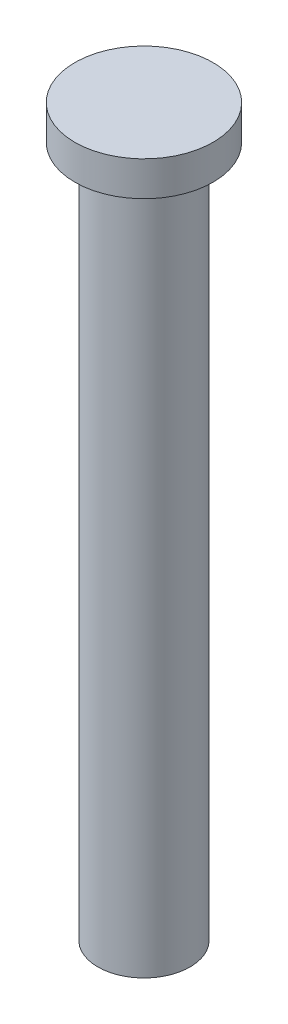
from build123d import *

# Parameters (mm, degrees)
SKETCH_1_R      = 4
EXTRUDE_1_DEPTH = 60
SKETCH_2_R      = 6
EXTRUDE_2_DEPTH = 3


with BuildPart() as part:
    # Sketch 1 → Extrude 1 (new body)
    with BuildSketch(Plane(origin=(0, 0, 0), x_dir=(1, 0, 0), z_dir=(0, 1, 0))):
        with Locations(Location((0, 0, 0), (0, 0, 270))):
            Circle(SKETCH_1_R)
    extrude(amount=EXTRUDE_1_DEPTH)

    # Sketch 2 → Extrude 2 (add)
    with BuildSketch(Plane(origin=(0, 60, 0), x_dir=(1, 0, 0), z_dir=(0, 1, 0))):
        with Locations(Location((0, 0, 0), (0, 0, 270))):
            Circle(SKETCH_2_R)
    extrude(amount=EXTRUDE_2_DEPTH)


solid = part.part
